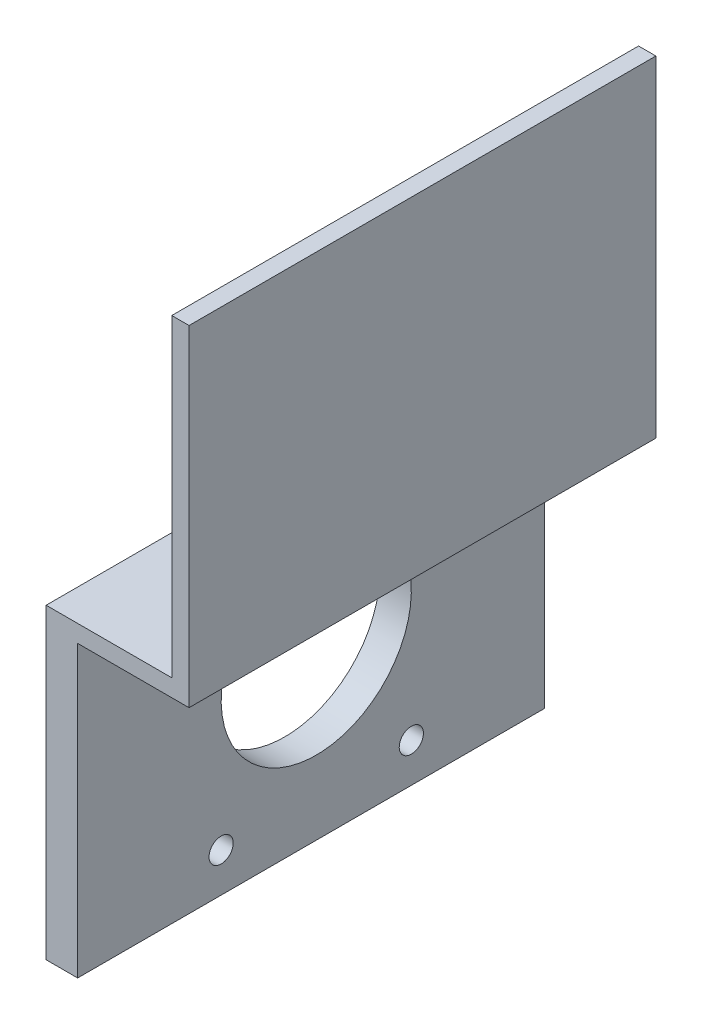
ISO-10303-21;
HEADER;
FILE_DESCRIPTION(('STEP AP214'),'2;1');
FILE_NAME('part.step','',(''),(''),'','','');
FILE_SCHEMA(('AUTOMOTIVE_DESIGN { 1 0 10303 214 1 1 1 1 }'));
ENDSEC;
DATA;
#1=APPLICATION_CONTEXT('core data for automotive mechanical design processes');
#2=APPLICATION_PROTOCOL_DEFINITION('international standard','automotive_design',2000,#1);
#3=PRODUCT_CONTEXT('',#1,'mechanical');
#4=PRODUCT('Part','Part','',(#3));
#5=PRODUCT_RELATED_PRODUCT_CATEGORY('part','',(#4));
#6=PRODUCT_DEFINITION_FORMATION('','',#4);
#7=PRODUCT_DEFINITION_CONTEXT('part definition',#1,'design');
#8=PRODUCT_DEFINITION('design','',#6,#7);
#9=PRODUCT_DEFINITION_SHAPE('','',#8);
#10=(LENGTH_UNIT() NAMED_UNIT(*) SI_UNIT(.MILLI.,.METRE.));
#11=(NAMED_UNIT(*) PLANE_ANGLE_UNIT() SI_UNIT($,.RADIAN.));
#12=(NAMED_UNIT(*) SI_UNIT($,.STERADIAN.) SOLID_ANGLE_UNIT());
#13=UNCERTAINTY_MEASURE_WITH_UNIT(LENGTH_MEASURE(1.E-05),#10,'distance_accuracy_value','');
#14=(GEOMETRIC_REPRESENTATION_CONTEXT(3) GLOBAL_UNCERTAINTY_ASSIGNED_CONTEXT((#13)) GLOBAL_UNIT_ASSIGNED_CONTEXT((#10,
#11,#12)) REPRESENTATION_CONTEXT('',''));
#15=CARTESIAN_POINT('',(0.,0.,0.));
#16=DIRECTION('',(0.,0.,1.));
#17=DIRECTION('',(1.,0.,0.));
#18=AXIS2_PLACEMENT_3D('',#15,#16,#17);
#19=CARTESIAN_POINT('',(27.3336480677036,182.323532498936,60.));
#20=DIRECTION('',(0.,-1.,0.));
#21=DIRECTION('',(0.,0.,-1.));
#22=AXIS2_PLACEMENT_3D('',#19,#20,#21);
#23=PLANE('',#22);
#24=DIRECTION('',(0.,0.,-1.));
#25=VECTOR('',#24,1.);
#26=CARTESIAN_POINT('',(99.9956639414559,182.323532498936,60.));
#27=LINE('',#26,#25);
#28=CARTESIAN_POINT('',(99.9956639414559,182.323532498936,60.));
#29=VERTEX_POINT('',#28);
#30=CARTESIAN_POINT('',(99.9956639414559,182.323532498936,-210.));
#31=VERTEX_POINT('',#30);
#32=EDGE_CURVE('E120',#29,#31,#27,.T.);
#33=ORIENTED_EDGE('',*,*,#32,.T.);
#34=DIRECTION('',(-1.,0.,0.));
#35=VECTOR('',#34,1.);
#36=CARTESIAN_POINT('',(27.3336480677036,182.323532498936,-210.));
#37=LINE('',#36,#35);
#38=CARTESIAN_POINT('',(27.3336480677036,182.323532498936,-210.));
#39=VERTEX_POINT('',#38);
#40=EDGE_CURVE('E113',#31,#39,#37,.T.);
#41=ORIENTED_EDGE('',*,*,#40,.T.);
#42=DIRECTION('',(0.,0.,-1.));
#43=VECTOR('',#42,1.);
#44=CARTESIAN_POINT('',(27.3336480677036,182.323532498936,60.));
#45=LINE('',#44,#43);
#46=CARTESIAN_POINT('',(27.3336480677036,182.323532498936,60.));
#47=VERTEX_POINT('',#46);
#48=EDGE_CURVE('E11',#47,#39,#45,.T.);
#49=ORIENTED_EDGE('',*,*,#48,.F.);
#50=DIRECTION('',(-1.,0.,0.));
#51=VECTOR('',#50,1.);
#52=CARTESIAN_POINT('',(27.3336480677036,182.323532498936,60.));
#53=LINE('',#52,#51);
#54=EDGE_CURVE('E145',#29,#47,#53,.T.);
#55=ORIENTED_EDGE('',*,*,#54,.F.);
#56=EDGE_LOOP('',(#33,#41,#49,#55));
#57=FACE_BOUND('',#56,.T.);
#58=ADVANCED_FACE('F37',(#57),#23,.F.);
#59=CARTESIAN_POINT('',(27.3336480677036,182.323532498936,60.));
#60=DIRECTION('',(1.,0.,0.));
#61=DIRECTION('',(0.,0.,-1.));
#62=AXIS2_PLACEMENT_3D('',#59,#60,#61);
#63=PLANE('',#62);
#64=CARTESIAN_POINT('',(27.3336480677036,27.3235324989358,-133.000000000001));
#65=DIRECTION('',(1.,0.,0.));
#66=DIRECTION('',(0.,1.,0.));
#67=AXIS2_PLACEMENT_3D('',#64,#65,#66);
#68=CIRCLE('',#67,7.00000000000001);
#69=CARTESIAN_POINT('',(27.3336480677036,34.3235324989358,-133.000000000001));
#70=VERTEX_POINT('',#69);
#71=EDGE_CURVE('E374',#70,#70,#68,.T.);
#72=ORIENTED_EDGE('',*,*,#71,.T.);
#73=EDGE_LOOP('',(#72));
#74=FACE_BOUND('',#73,.T.);
#75=CARTESIAN_POINT('',(27.3336480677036,27.3235324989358,-23.0000000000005));
#76=DIRECTION('',(1.,0.,0.));
#77=DIRECTION('',(0.,1.,0.));
#78=AXIS2_PLACEMENT_3D('',#75,#76,#77);
#79=CIRCLE('',#78,7.);
#80=CARTESIAN_POINT('',(27.3336480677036,34.3235324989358,-23.0000000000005));
#81=VERTEX_POINT('',#80);
#82=EDGE_CURVE('E368',#81,#81,#79,.T.);
#83=ORIENTED_EDGE('',*,*,#82,.T.);
#84=EDGE_LOOP('',(#83));
#85=FACE_BOUND('',#84,.T.);
#86=CARTESIAN_POINT('',(27.3336480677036,152.323532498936,-23.0000000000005));
#87=DIRECTION('',(1.,0.,0.));
#88=DIRECTION('',(0.,1.,0.));
#89=AXIS2_PLACEMENT_3D('',#86,#87,#88);
#90=CIRCLE('',#89,7.00000000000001);
#91=CARTESIAN_POINT('',(27.3336480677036,159.323532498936,-23.0000000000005));
#92=VERTEX_POINT('',#91);
#93=EDGE_CURVE('E362',#92,#92,#90,.T.);
#94=ORIENTED_EDGE('',*,*,#93,.T.);
#95=EDGE_LOOP('',(#94));
#96=FACE_BOUND('',#95,.T.);
#97=CARTESIAN_POINT('',(27.3336480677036,152.323532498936,-133.));
#98=DIRECTION('',(1.,0.,0.));
#99=DIRECTION('',(0.,1.,0.));
#100=AXIS2_PLACEMENT_3D('',#97,#98,#99);
#101=CIRCLE('',#100,7.00000000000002);
#102=CARTESIAN_POINT('',(27.3336480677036,159.323532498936,-133.));
#103=VERTEX_POINT('',#102);
#104=EDGE_CURVE('E352',#103,#103,#101,.T.);
#105=ORIENTED_EDGE('',*,*,#104,.T.);
#106=EDGE_LOOP('',(#105));
#107=FACE_BOUND('',#106,.T.);
#108=CARTESIAN_POINT('',(27.3336480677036,102.323532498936,-78.0000000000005));
#109=DIRECTION('',(1.,0.,0.));
#110=DIRECTION('',(0.,1.,0.));
#111=AXIS2_PLACEMENT_3D('',#108,#109,#110);
#112=CIRCLE('',#111,55.);
#113=CARTESIAN_POINT('',(27.3336480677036,157.323532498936,-78.0000000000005));
#114=VERTEX_POINT('',#113);
#115=EDGE_CURVE('E121',#114,#114,#112,.T.);
#116=ORIENTED_EDGE('',*,*,#115,.T.);
#117=EDGE_LOOP('',(#116));
#118=FACE_BOUND('',#117,.T.);
#119=ORIENTED_EDGE('',*,*,#48,.T.);
#120=DIRECTION('',(0.,-1.,0.));
#121=VECTOR('',#120,1.);
#122=CARTESIAN_POINT('',(27.3336480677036,182.323532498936,-210.));
#123=LINE('',#122,#121);
#124=CARTESIAN_POINT('',(27.3336480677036,4.70544838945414,-210.));
#125=VERTEX_POINT('',#124);
#126=EDGE_CURVE('E103',#39,#125,#123,.T.);
#127=ORIENTED_EDGE('',*,*,#126,.T.);
#128=DIRECTION('',(0.,0.,-1.));
#129=VECTOR('',#128,1.);
#130=CARTESIAN_POINT('',(27.3336480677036,4.70544838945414,60.));
#131=LINE('',#130,#129);
#132=CARTESIAN_POINT('',(27.3336480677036,4.70544838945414,60.));
#133=VERTEX_POINT('',#132);
#134=EDGE_CURVE('E44',#133,#125,#131,.T.);
#135=ORIENTED_EDGE('',*,*,#134,.F.);
#136=DIRECTION('',(0.,-1.,0.));
#137=VECTOR('',#136,1.);
#138=CARTESIAN_POINT('',(27.3336480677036,182.323532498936,60.));
#139=LINE('',#138,#137);
#140=EDGE_CURVE('E104',#47,#133,#139,.T.);
#141=ORIENTED_EDGE('',*,*,#140,.F.);
#142=EDGE_LOOP('',(#119,#127,#135,#141));
#143=FACE_BOUND('',#142,.T.);
#144=ADVANCED_FACE('F101',(#74,#85,#96,#107,#118,#143),#63,.F.);
#145=CARTESIAN_POINT('',(27.3336480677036,4.70544838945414,60.));
#146=DIRECTION('',(0.,1.,0.));
#147=DIRECTION('',(-1.,0.,0.));
#148=AXIS2_PLACEMENT_3D('',#145,#146,#147);
#149=PLANE('',#148);
#150=ORIENTED_EDGE('',*,*,#134,.T.);
#151=DIRECTION('',(1.,0.,0.));
#152=VECTOR('',#151,1.);
#153=CARTESIAN_POINT('',(27.3336480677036,4.70544838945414,-210.));
#154=LINE('',#153,#152);
#155=CARTESIAN_POINT('',(45.5580179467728,4.70544838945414,-210.));
#156=VERTEX_POINT('',#155);
#157=EDGE_CURVE('E117',#125,#156,#154,.T.);
#158=ORIENTED_EDGE('',*,*,#157,.T.);
#159=DIRECTION('',(0.,0.,-1.));
#160=VECTOR('',#159,1.);
#161=CARTESIAN_POINT('',(45.5580179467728,4.70544838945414,60.));
#162=LINE('',#161,#160);
#163=CARTESIAN_POINT('',(45.5580179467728,4.70544838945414,60.));
#164=VERTEX_POINT('',#163);
#165=EDGE_CURVE('E168',#164,#156,#162,.T.);
#166=ORIENTED_EDGE('',*,*,#165,.F.);
#167=DIRECTION('',(1.,0.,0.));
#168=VECTOR('',#167,1.);
#169=CARTESIAN_POINT('',(27.3336480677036,4.70544838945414,60.));
#170=LINE('',#169,#168);
#171=EDGE_CURVE('E148',#133,#164,#170,.T.);
#172=ORIENTED_EDGE('',*,*,#171,.F.);
#173=EDGE_LOOP('',(#150,#158,#166,#172));
#174=FACE_BOUND('',#173,.T.);
#175=ADVANCED_FACE('F172',(#174),#149,.F.);
#176=CARTESIAN_POINT('',(45.5580179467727,172.323532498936,60.));
#177=DIRECTION('',(-1.,0.,0.));
#178=DIRECTION('',(0.,-1.,0.));
#179=AXIS2_PLACEMENT_3D('',#176,#177,#178);
#180=PLANE('',#179);
#181=CARTESIAN_POINT('',(45.5580179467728,27.3235324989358,-133.000000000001));
#182=DIRECTION('',(1.,0.,0.));
#183=DIRECTION('',(0.,1.,0.));
#184=AXIS2_PLACEMENT_3D('',#181,#182,#183);
#185=CIRCLE('',#184,7.00000000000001);
#186=CARTESIAN_POINT('',(45.5580179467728,34.3235324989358,-133.000000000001));
#187=VERTEX_POINT('',#186);
#188=EDGE_CURVE('E376',#187,#187,#185,.T.);
#189=ORIENTED_EDGE('',*,*,#188,.F.);
#190=EDGE_LOOP('',(#189));
#191=FACE_BOUND('',#190,.T.);
#192=CARTESIAN_POINT('',(45.5580179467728,27.3235324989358,-23.0000000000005));
#193=DIRECTION('',(1.,0.,0.));
#194=DIRECTION('',(0.,1.,0.));
#195=AXIS2_PLACEMENT_3D('',#192,#193,#194);
#196=CIRCLE('',#195,7.);
#197=CARTESIAN_POINT('',(45.5580179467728,34.3235324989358,-23.0000000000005));
#198=VERTEX_POINT('',#197);
#199=EDGE_CURVE('E371',#198,#198,#196,.T.);
#200=ORIENTED_EDGE('',*,*,#199,.F.);
#201=EDGE_LOOP('',(#200));
#202=FACE_BOUND('',#201,.T.);
#203=CARTESIAN_POINT('',(45.5580179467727,152.323532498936,-23.0000000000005));
#204=DIRECTION('',(1.,0.,0.));
#205=DIRECTION('',(0.,1.,0.));
#206=AXIS2_PLACEMENT_3D('',#203,#204,#205);
#207=CIRCLE('',#206,7.00000000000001);
#208=CARTESIAN_POINT('',(45.5580179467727,159.323532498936,-23.0000000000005));
#209=VERTEX_POINT('',#208);
#210=EDGE_CURVE('E365',#209,#209,#207,.T.);
#211=ORIENTED_EDGE('',*,*,#210,.F.);
#212=EDGE_LOOP('',(#211));
#213=FACE_BOUND('',#212,.T.);
#214=CARTESIAN_POINT('',(45.5580179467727,152.323532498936,-133.));
#215=DIRECTION('',(1.,0.,0.));
#216=DIRECTION('',(0.,1.,0.));
#217=AXIS2_PLACEMENT_3D('',#214,#215,#216);
#218=CIRCLE('',#217,7.00000000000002);
#219=CARTESIAN_POINT('',(45.5580179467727,159.323532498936,-133.));
#220=VERTEX_POINT('',#219);
#221=EDGE_CURVE('E357',#220,#220,#218,.T.);
#222=ORIENTED_EDGE('',*,*,#221,.F.);
#223=EDGE_LOOP('',(#222));
#224=FACE_BOUND('',#223,.T.);
#225=CARTESIAN_POINT('',(45.5580179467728,102.323532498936,-78.0000000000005));
#226=DIRECTION('',(1.,0.,0.));
#227=DIRECTION('',(0.,1.,0.));
#228=AXIS2_PLACEMENT_3D('',#225,#226,#227);
#229=CIRCLE('',#228,55.);
#230=CARTESIAN_POINT('',(45.5580179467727,157.323532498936,-78.0000000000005));
#231=VERTEX_POINT('',#230);
#232=EDGE_CURVE('E124',#231,#231,#229,.T.);
#233=ORIENTED_EDGE('',*,*,#232,.F.);
#234=EDGE_LOOP('',(#233));
#235=FACE_BOUND('',#234,.T.);
#236=ORIENTED_EDGE('',*,*,#165,.T.);
#237=DIRECTION('',(0.,1.,0.));
#238=VECTOR('',#237,1.);
#239=CARTESIAN_POINT('',(45.5580179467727,172.323532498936,-210.));
#240=LINE('',#239,#238);
#241=CARTESIAN_POINT('',(45.5580179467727,172.323532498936,-210.));
#242=VERTEX_POINT('',#241);
#243=EDGE_CURVE('E129',#156,#242,#240,.T.);
#244=ORIENTED_EDGE('',*,*,#243,.T.);
#245=DIRECTION('',(0.,0.,-1.));
#246=VECTOR('',#245,1.);
#247=CARTESIAN_POINT('',(45.5580179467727,172.323532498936,60.));
#248=LINE('',#247,#246);
#249=CARTESIAN_POINT('',(45.5580179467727,172.323532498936,60.));
#250=VERTEX_POINT('',#249);
#251=EDGE_CURVE('E166',#250,#242,#248,.T.);
#252=ORIENTED_EDGE('',*,*,#251,.F.);
#253=DIRECTION('',(0.,1.,0.));
#254=VECTOR('',#253,1.);
#255=CARTESIAN_POINT('',(45.5580179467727,172.323532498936,60.));
#256=LINE('',#255,#254);
#257=EDGE_CURVE('E150',#164,#250,#256,.T.);
#258=ORIENTED_EDGE('',*,*,#257,.F.);
#259=EDGE_LOOP('',(#236,#244,#252,#258));
#260=FACE_BOUND('',#259,.T.);
#261=ADVANCED_FACE('F180',(#191,#202,#213,#224,#235,#260),#180,.F.);
#262=CARTESIAN_POINT('',(109.995663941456,172.323532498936,60.));
#263=DIRECTION('',(0.,1.,0.));
#264=DIRECTION('',(0.,0.,1.));
#265=AXIS2_PLACEMENT_3D('',#262,#263,#264);
#266=PLANE('',#265);
#267=ORIENTED_EDGE('',*,*,#251,.T.);
#268=DIRECTION('',(1.,0.,0.));
#269=VECTOR('',#268,1.);
#270=CARTESIAN_POINT('',(109.995663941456,172.323532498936,-210.));
#271=LINE('',#270,#269);
#272=CARTESIAN_POINT('',(109.995663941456,172.323532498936,-210.));
#273=VERTEX_POINT('',#272);
#274=EDGE_CURVE('E133',#242,#273,#271,.T.);
#275=ORIENTED_EDGE('',*,*,#274,.T.);
#276=DIRECTION('',(0.,0.,-1.));
#277=VECTOR('',#276,1.);
#278=CARTESIAN_POINT('',(109.995663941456,172.323532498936,60.));
#279=LINE('',#278,#277);
#280=CARTESIAN_POINT('',(109.995663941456,172.323532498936,60.));
#281=VERTEX_POINT('',#280);
#282=EDGE_CURVE('E163',#281,#273,#279,.T.);
#283=ORIENTED_EDGE('',*,*,#282,.F.);
#284=DIRECTION('',(1.,0.,0.));
#285=VECTOR('',#284,1.);
#286=CARTESIAN_POINT('',(109.995663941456,172.323532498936,60.));
#287=LINE('',#286,#285);
#288=EDGE_CURVE('E152',#250,#281,#287,.T.);
#289=ORIENTED_EDGE('',*,*,#288,.F.);
#290=EDGE_LOOP('',(#267,#275,#283,#289));
#291=FACE_BOUND('',#290,.T.);
#292=ADVANCED_FACE('F183',(#291),#266,.F.);
#293=CARTESIAN_POINT('',(109.995663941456,363.768166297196,60.));
#294=DIRECTION('',(-1.,0.,0.));
#295=DIRECTION('',(0.,-1.,0.));
#296=AXIS2_PLACEMENT_3D('',#293,#294,#295);
#297=PLANE('',#296);
#298=ORIENTED_EDGE('',*,*,#282,.T.);
#299=DIRECTION('',(0.,1.,0.));
#300=VECTOR('',#299,1.);
#301=CARTESIAN_POINT('',(109.995663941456,363.768166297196,-210.));
#302=LINE('',#301,#300);
#303=CARTESIAN_POINT('',(109.995663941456,363.768166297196,-210.));
#304=VERTEX_POINT('',#303);
#305=EDGE_CURVE('E136',#273,#304,#302,.T.);
#306=ORIENTED_EDGE('',*,*,#305,.T.);
#307=DIRECTION('',(0.,0.,-1.));
#308=VECTOR('',#307,1.);
#309=CARTESIAN_POINT('',(109.995663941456,363.768166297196,60.));
#310=LINE('',#309,#308);
#311=CARTESIAN_POINT('',(109.995663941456,363.768166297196,60.));
#312=VERTEX_POINT('',#311);
#313=EDGE_CURVE('E161',#312,#304,#310,.T.);
#314=ORIENTED_EDGE('',*,*,#313,.F.);
#315=DIRECTION('',(0.,1.,0.));
#316=VECTOR('',#315,1.);
#317=CARTESIAN_POINT('',(109.995663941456,363.768166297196,60.));
#318=LINE('',#317,#316);
#319=EDGE_CURVE('E154',#281,#312,#318,.T.);
#320=ORIENTED_EDGE('',*,*,#319,.F.);
#321=EDGE_LOOP('',(#298,#306,#314,#320));
#322=FACE_BOUND('',#321,.T.);
#323=ADVANCED_FACE('F188',(#322),#297,.F.);
#324=CARTESIAN_POINT('',(99.9956639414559,363.768166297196,60.));
#325=DIRECTION('',(0.,-1.,0.));
#326=DIRECTION('',(0.,0.,-1.));
#327=AXIS2_PLACEMENT_3D('',#324,#325,#326);
#328=PLANE('',#327);
#329=ORIENTED_EDGE('',*,*,#313,.T.);
#330=DIRECTION('',(-1.,0.,0.));
#331=VECTOR('',#330,1.);
#332=CARTESIAN_POINT('',(99.9956639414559,363.768166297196,-210.));
#333=LINE('',#332,#331);
#334=CARTESIAN_POINT('',(99.9956639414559,363.768166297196,-210.));
#335=VERTEX_POINT('',#334);
#336=EDGE_CURVE('E140',#304,#335,#333,.T.);
#337=ORIENTED_EDGE('',*,*,#336,.T.);
#338=DIRECTION('',(0.,0.,-1.));
#339=VECTOR('',#338,1.);
#340=CARTESIAN_POINT('',(99.9956639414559,363.768166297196,60.));
#341=LINE('',#340,#339);
#342=CARTESIAN_POINT('',(99.9956639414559,363.768166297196,60.));
#343=VERTEX_POINT('',#342);
#344=EDGE_CURVE('E159',#343,#335,#341,.T.);
#345=ORIENTED_EDGE('',*,*,#344,.F.);
#346=DIRECTION('',(-1.,0.,0.));
#347=VECTOR('',#346,1.);
#348=CARTESIAN_POINT('',(99.9956639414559,363.768166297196,60.));
#349=LINE('',#348,#347);
#350=EDGE_CURVE('E56',#312,#343,#349,.T.);
#351=ORIENTED_EDGE('',*,*,#350,.F.);
#352=EDGE_LOOP('',(#329,#337,#345,#351));
#353=FACE_BOUND('',#352,.T.);
#354=ADVANCED_FACE('F191',(#353),#328,.F.);
#355=CARTESIAN_POINT('',(99.9956639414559,182.323532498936,60.));
#356=DIRECTION('',(1.,0.,0.));
#357=DIRECTION('',(0.,0.,-1.));
#358=AXIS2_PLACEMENT_3D('',#355,#356,#357);
#359=PLANE('',#358);
#360=ORIENTED_EDGE('',*,*,#344,.T.);
#361=DIRECTION('',(0.,-1.,0.));
#362=VECTOR('',#361,1.);
#363=CARTESIAN_POINT('',(99.9956639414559,182.323532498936,-210.));
#364=LINE('',#363,#362);
#365=EDGE_CURVE('E143',#335,#31,#364,.T.);
#366=ORIENTED_EDGE('',*,*,#365,.T.);
#367=ORIENTED_EDGE('',*,*,#32,.F.);
#368=DIRECTION('',(0.,-1.,0.));
#369=VECTOR('',#368,1.);
#370=CARTESIAN_POINT('',(99.9956639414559,182.323532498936,60.));
#371=LINE('',#370,#369);
#372=EDGE_CURVE('E51',#343,#29,#371,.T.);
#373=ORIENTED_EDGE('',*,*,#372,.F.);
#374=EDGE_LOOP('',(#360,#366,#367,#373));
#375=FACE_BOUND('',#374,.T.);
#376=ADVANCED_FACE('F193',(#375),#359,.F.);
#377=CARTESIAN_POINT('',(99.9956639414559,182.323532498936,60.));
#378=DIRECTION('',(0.,0.,1.));
#379=DIRECTION('',(1.,0.,0.));
#380=AXIS2_PLACEMENT_3D('',#377,#378,#379);
#381=PLANE('',#380);
#382=ORIENTED_EDGE('',*,*,#54,.T.);
#383=ORIENTED_EDGE('',*,*,#140,.T.);
#384=ORIENTED_EDGE('',*,*,#171,.T.);
#385=ORIENTED_EDGE('',*,*,#257,.T.);
#386=ORIENTED_EDGE('',*,*,#288,.T.);
#387=ORIENTED_EDGE('',*,*,#319,.T.);
#388=ORIENTED_EDGE('',*,*,#350,.T.);
#389=ORIENTED_EDGE('',*,*,#372,.T.);
#390=EDGE_LOOP('',(#382,#383,#384,#385,#386,#387,#388,#389));
#391=FACE_BOUND('',#390,.T.);
#392=ADVANCED_FACE('F175',(#391),#381,.T.);
#393=CARTESIAN_POINT('',(99.9956639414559,182.323532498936,-210.));
#394=DIRECTION('',(0.,0.,1.));
#395=DIRECTION('',(1.,0.,0.));
#396=AXIS2_PLACEMENT_3D('',#393,#394,#395);
#397=PLANE('',#396);
#398=ORIENTED_EDGE('',*,*,#40,.F.);
#399=ORIENTED_EDGE('',*,*,#365,.F.);
#400=ORIENTED_EDGE('',*,*,#336,.F.);
#401=ORIENTED_EDGE('',*,*,#305,.F.);
#402=ORIENTED_EDGE('',*,*,#274,.F.);
#403=ORIENTED_EDGE('',*,*,#243,.F.);
#404=ORIENTED_EDGE('',*,*,#157,.F.);
#405=ORIENTED_EDGE('',*,*,#126,.F.);
#406=EDGE_LOOP('',(#398,#399,#400,#401,#402,#403,#404,#405));
#407=FACE_BOUND('',#406,.T.);
#408=ADVANCED_FACE('F111',(#407),#397,.F.);
#409=CARTESIAN_POINT('',(27.3336480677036,102.323532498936,-78.0000000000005));
#410=DIRECTION('',(1.,0.,0.));
#411=DIRECTION('',(0.,1.,0.));
#412=AXIS2_PLACEMENT_3D('',#409,#410,#411);
#413=CYLINDRICAL_SURFACE('',#412,55.);
#414=ORIENTED_EDGE('',*,*,#115,.F.);
#415=EDGE_LOOP('',(#414));
#416=FACE_BOUND('',#415,.T.);
#417=ORIENTED_EDGE('',*,*,#232,.T.);
#418=EDGE_LOOP('',(#417));
#419=FACE_BOUND('',#418,.T.);
#420=ADVANCED_FACE('F240',(#416,#419),#413,.F.);
#421=CARTESIAN_POINT('',(27.3336480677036,152.323532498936,-133.));
#422=DIRECTION('',(1.,0.,0.));
#423=DIRECTION('',(0.,1.,0.));
#424=AXIS2_PLACEMENT_3D('',#421,#422,#423);
#425=CYLINDRICAL_SURFACE('',#424,7.00000000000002);
#426=ORIENTED_EDGE('',*,*,#104,.F.);
#427=EDGE_LOOP('',(#426));
#428=FACE_BOUND('',#427,.T.);
#429=ORIENTED_EDGE('',*,*,#221,.T.);
#430=EDGE_LOOP('',(#429));
#431=FACE_BOUND('',#430,.T.);
#432=ADVANCED_FACE('F245',(#428,#431),#425,.F.);
#433=CARTESIAN_POINT('',(27.3336480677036,152.323532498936,-23.0000000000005));
#434=DIRECTION('',(1.,0.,0.));
#435=DIRECTION('',(0.,1.,0.));
#436=AXIS2_PLACEMENT_3D('',#433,#434,#435);
#437=CYLINDRICAL_SURFACE('',#436,7.00000000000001);
#438=ORIENTED_EDGE('',*,*,#93,.F.);
#439=EDGE_LOOP('',(#438));
#440=FACE_BOUND('',#439,.T.);
#441=ORIENTED_EDGE('',*,*,#210,.T.);
#442=EDGE_LOOP('',(#441));
#443=FACE_BOUND('',#442,.T.);
#444=ADVANCED_FACE('F256',(#440,#443),#437,.F.);
#445=CARTESIAN_POINT('',(27.3336480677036,27.3235324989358,-23.0000000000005));
#446=DIRECTION('',(1.,0.,0.));
#447=DIRECTION('',(0.,1.,0.));
#448=AXIS2_PLACEMENT_3D('',#445,#446,#447);
#449=CYLINDRICAL_SURFACE('',#448,7.);
#450=ORIENTED_EDGE('',*,*,#82,.F.);
#451=EDGE_LOOP('',(#450));
#452=FACE_BOUND('',#451,.T.);
#453=ORIENTED_EDGE('',*,*,#199,.T.);
#454=EDGE_LOOP('',(#453));
#455=FACE_BOUND('',#454,.T.);
#456=ADVANCED_FACE('F266',(#452,#455),#449,.F.);
#457=CARTESIAN_POINT('',(27.3336480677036,27.3235324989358,-133.000000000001));
#458=DIRECTION('',(1.,0.,0.));
#459=DIRECTION('',(0.,1.,0.));
#460=AXIS2_PLACEMENT_3D('',#457,#458,#459);
#461=CYLINDRICAL_SURFACE('',#460,7.00000000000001);
#462=ORIENTED_EDGE('',*,*,#71,.F.);
#463=EDGE_LOOP('',(#462));
#464=FACE_BOUND('',#463,.T.);
#465=ORIENTED_EDGE('',*,*,#188,.T.);
#466=EDGE_LOOP('',(#465));
#467=FACE_BOUND('',#466,.T.);
#468=ADVANCED_FACE('F274',(#464,#467),#461,.F.);
#469=CLOSED_SHELL('',(#58,#144,#175,#261,#292,#323,#354,#376,#392,#408,#420,#432,#444,#456,#468));
#470=MANIFOLD_SOLID_BREP('B2',#469);
#471=ADVANCED_BREP_SHAPE_REPRESENTATION('',(#18,#470),#14);
#472=SHAPE_DEFINITION_REPRESENTATION(#9,#471);
ENDSEC;
END-ISO-10303-21;
